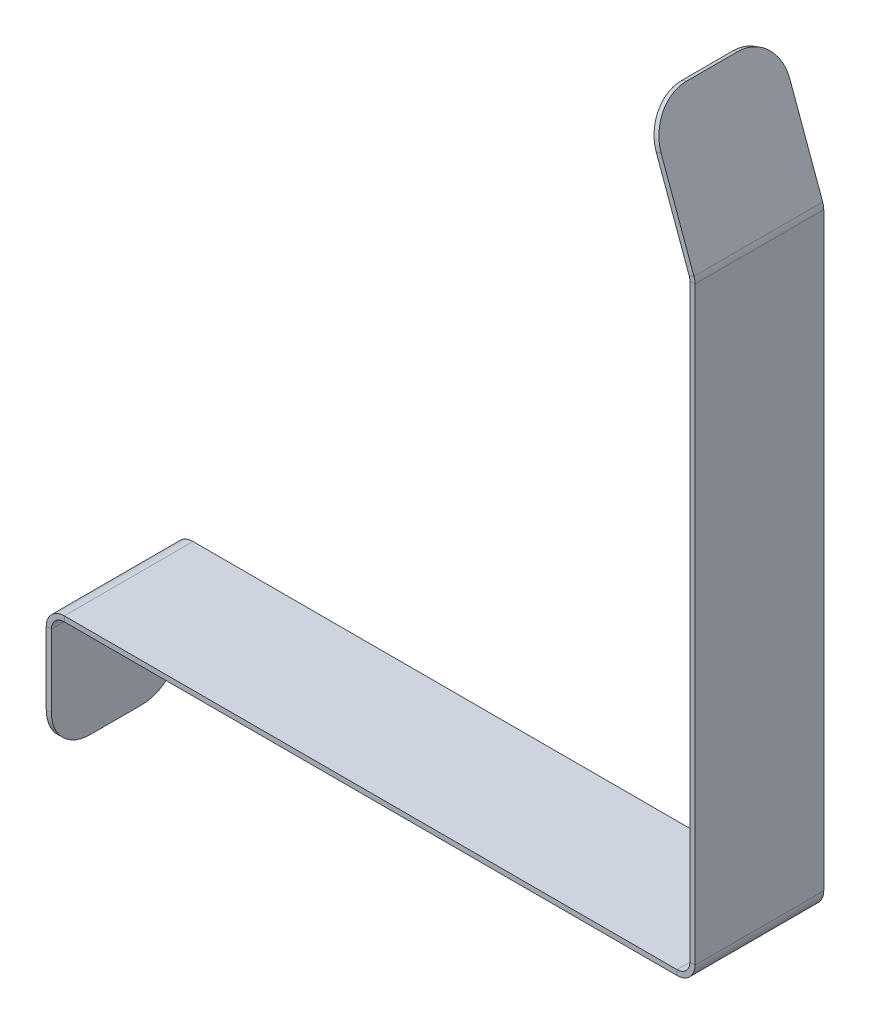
ISO-10303-21;
HEADER;
FILE_DESCRIPTION(('STEP AP214'),'2;1');
FILE_NAME('part.step','',(''),(''),'','','');
FILE_SCHEMA(('AUTOMOTIVE_DESIGN { 1 0 10303 214 1 1 1 1 }'));
ENDSEC;
DATA;
#1=APPLICATION_CONTEXT('core data for automotive mechanical design processes');
#2=APPLICATION_PROTOCOL_DEFINITION('international standard','automotive_design',2000,#1);
#3=PRODUCT_CONTEXT('',#1,'mechanical');
#4=PRODUCT('Part','Part','',(#3));
#5=PRODUCT_RELATED_PRODUCT_CATEGORY('part','',(#4));
#6=PRODUCT_DEFINITION_FORMATION('','',#4);
#7=PRODUCT_DEFINITION_CONTEXT('part definition',#1,'design');
#8=PRODUCT_DEFINITION('design','',#6,#7);
#9=PRODUCT_DEFINITION_SHAPE('','',#8);
#10=(LENGTH_UNIT() NAMED_UNIT(*) SI_UNIT(.MILLI.,.METRE.));
#11=(NAMED_UNIT(*) PLANE_ANGLE_UNIT() SI_UNIT($,.RADIAN.));
#12=(NAMED_UNIT(*) SI_UNIT($,.STERADIAN.) SOLID_ANGLE_UNIT());
#13=UNCERTAINTY_MEASURE_WITH_UNIT(LENGTH_MEASURE(1.E-05),#10,'distance_accuracy_value','');
#14=(GEOMETRIC_REPRESENTATION_CONTEXT(3) GLOBAL_UNCERTAINTY_ASSIGNED_CONTEXT((#13)) GLOBAL_UNIT_ASSIGNED_CONTEXT((#10,
#11,#12)) REPRESENTATION_CONTEXT('',''));
#15=CARTESIAN_POINT('',(0.,0.,0.));
#16=DIRECTION('',(0.,0.,1.));
#17=DIRECTION('',(1.,0.,0.));
#18=AXIS2_PLACEMENT_3D('',#15,#16,#17);
#19=CARTESIAN_POINT('',(0.,0.,5.00000000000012));
#20=DIRECTION('',(-1.,0.,0.));
#21=DIRECTION('',(0.,0.,1.));
#22=AXIS2_PLACEMENT_3D('',#19,#20,#21);
#23=PLANE('',#22);
#24=DIRECTION('',(0.,0.,-1.));
#25=VECTOR('',#24,1.);
#26=CARTESIAN_POINT('',(0.,0.,5.00000000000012));
#27=LINE('',#26,#25);
#28=CARTESIAN_POINT('',(0.,0.,2.00000000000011));
#29=VERTEX_POINT('',#28);
#30=CARTESIAN_POINT('',(0.,0.,-2.00000000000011));
#31=VERTEX_POINT('',#30);
#32=EDGE_CURVE('E217',#29,#31,#27,.T.);
#33=ORIENTED_EDGE('',*,*,#32,.F.);
#34=CARTESIAN_POINT('',(0.,3.,2.00000000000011));
#35=DIRECTION('',(-1.,0.,0.));
#36=DIRECTION('',(0.,0.,1.));
#37=AXIS2_PLACEMENT_3D('',#34,#35,#36);
#38=CIRCLE('',#37,3.);
#39=CARTESIAN_POINT('',(0.,3.,5.00000000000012));
#40=VERTEX_POINT('',#39);
#41=EDGE_CURVE('E221',#29,#40,#38,.T.);
#42=ORIENTED_EDGE('',*,*,#41,.T.);
#43=DIRECTION('',(0.,0.999999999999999,0.));
#44=VECTOR('',#43,1.);
#45=CARTESIAN_POINT('',(0.,0.,5.00000000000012));
#46=LINE('',#45,#44);
#47=CARTESIAN_POINT('',(0.,8.60000000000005,5.00000000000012));
#48=VERTEX_POINT('',#47);
#49=EDGE_CURVE('E234',#40,#48,#46,.T.);
#50=ORIENTED_EDGE('',*,*,#49,.T.);
#51=DIRECTION('',(0.,0.,-1.));
#52=VECTOR('',#51,1.);
#53=CARTESIAN_POINT('',(0.,8.60000000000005,5.00000000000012));
#54=LINE('',#53,#52);
#55=CARTESIAN_POINT('',(0.,8.60000000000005,-5.00000000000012));
#56=VERTEX_POINT('',#55);
#57=EDGE_CURVE('E231',#48,#56,#54,.T.);
#58=ORIENTED_EDGE('',*,*,#57,.T.);
#59=DIRECTION('',(0.,0.999999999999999,0.));
#60=VECTOR('',#59,1.);
#61=CARTESIAN_POINT('',(0.,0.,-5.00000000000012));
#62=LINE('',#61,#60);
#63=CARTESIAN_POINT('',(0.,3.,-5.00000000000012));
#64=VERTEX_POINT('',#63);
#65=EDGE_CURVE('E203',#64,#56,#62,.T.);
#66=ORIENTED_EDGE('',*,*,#65,.F.);
#67=CARTESIAN_POINT('',(0.,3.,-2.00000000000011));
#68=DIRECTION('',(-1.,0.,0.));
#69=DIRECTION('',(0.,0.,1.));
#70=AXIS2_PLACEMENT_3D('',#67,#68,#69);
#71=CIRCLE('',#70,3.);
#72=EDGE_CURVE('E225',#64,#31,#71,.T.);
#73=ORIENTED_EDGE('',*,*,#72,.T.);
#74=EDGE_LOOP('',(#33,#42,#50,#58,#66,#73));
#75=FACE_BOUND('',#74,.T.);
#76=ADVANCED_FACE('F30',(#75),#23,.T.);
#77=CARTESIAN_POINT('',(26.378779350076,-1.11022302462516E-13,5.00000000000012));
#78=DIRECTION('',(0.,0.,1.));
#79=DIRECTION('',(0.,0.999999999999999,0.));
#80=AXIS2_PLACEMENT_3D('',#77,#78,#79);
#81=PLANE('',#80);
#82=DIRECTION('',(-1.,0.,0.));
#83=VECTOR('',#82,1.);
#84=CARTESIAN_POINT('',(26.378779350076,8.59999999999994,5.00000000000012));
#85=LINE('',#84,#83);
#86=CARTESIAN_POINT('',(0.400000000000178,8.60000000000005,5.));
#87=VERTEX_POINT('',#86);
#88=EDGE_CURVE('E190',#87,#48,#85,.T.);
#89=ORIENTED_EDGE('',*,*,#88,.T.);
#90=ORIENTED_EDGE('',*,*,#49,.F.);
#91=DIRECTION('',(-1.,0.,0.));
#92=VECTOR('',#91,1.);
#93=CARTESIAN_POINT('',(26.378779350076,2.99999999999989,5.00000000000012));
#94=LINE('',#93,#92);
#95=CARTESIAN_POINT('',(0.400000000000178,3.,5.));
#96=VERTEX_POINT('',#95);
#97=EDGE_CURVE('E11',#96,#40,#94,.T.);
#98=ORIENTED_EDGE('',*,*,#97,.F.);
#99=DIRECTION('',(0.,0.999999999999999,0.));
#100=VECTOR('',#99,1.);
#101=CARTESIAN_POINT('',(0.400000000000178,0.,5.));
#102=LINE('',#101,#100);
#103=EDGE_CURVE('E222',#96,#87,#102,.T.);
#104=ORIENTED_EDGE('',*,*,#103,.T.);
#105=EDGE_LOOP('',(#89,#90,#98,#104));
#106=FACE_BOUND('',#105,.T.);
#107=ADVANCED_FACE('F32',(#106),#81,.T.);
#108=CARTESIAN_POINT('',(26.378779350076,2.99999999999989,2.));
#109=DIRECTION('',(-1.,0.,0.));
#110=DIRECTION('',(0.,-0.999999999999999,0.));
#111=AXIS2_PLACEMENT_3D('',#108,#109,#110);
#112=CYLINDRICAL_SURFACE('',#111,3.);
#113=ORIENTED_EDGE('',*,*,#41,.F.);
#114=DIRECTION('',(-1.,0.,0.));
#115=VECTOR('',#114,1.);
#116=CARTESIAN_POINT('',(26.378779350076,-1.11022302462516E-13,2.));
#117=LINE('',#116,#115);
#118=CARTESIAN_POINT('',(0.399999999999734,0.,1.99999999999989));
#119=VERTEX_POINT('',#118);
#120=EDGE_CURVE('E38',#119,#29,#117,.T.);
#121=ORIENTED_EDGE('',*,*,#120,.F.);
#122=CARTESIAN_POINT('',(0.399999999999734,3.,1.99999999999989));
#123=DIRECTION('',(-1.,0.,0.));
#124=DIRECTION('',(0.,0.,1.));
#125=AXIS2_PLACEMENT_3D('',#122,#123,#124);
#126=CIRCLE('',#125,3.);
#127=EDGE_CURVE('E52',#96,#119,#126,.F.);
#128=ORIENTED_EDGE('',*,*,#127,.F.);
#129=ORIENTED_EDGE('',*,*,#97,.T.);
#130=EDGE_LOOP('',(#113,#121,#128,#129));
#131=FACE_BOUND('',#130,.T.);
#132=ADVANCED_FACE('F220',(#131),#112,.T.);
#133=CARTESIAN_POINT('',(26.378779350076,-1.11022302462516E-13,5.00000000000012));
#134=DIRECTION('',(0.,0.999999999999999,0.));
#135=DIRECTION('',(-1.,0.,0.));
#136=AXIS2_PLACEMENT_3D('',#133,#134,#135);
#137=PLANE('',#136);
#138=ORIENTED_EDGE('',*,*,#32,.T.);
#139=DIRECTION('',(-1.,0.,0.));
#140=VECTOR('',#139,1.);
#141=CARTESIAN_POINT('',(26.3787793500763,-1.11022302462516E-13,-2.));
#142=LINE('',#141,#140);
#143=CARTESIAN_POINT('',(0.399999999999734,0.,-2.00000000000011));
#144=VERTEX_POINT('',#143);
#145=EDGE_CURVE('E206',#144,#31,#142,.T.);
#146=ORIENTED_EDGE('',*,*,#145,.F.);
#147=DIRECTION('',(0.,0.,-1.));
#148=VECTOR('',#147,1.);
#149=CARTESIAN_POINT('',(0.400000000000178,0.,5.));
#150=LINE('',#149,#148);
#151=EDGE_CURVE('E218',#119,#144,#150,.T.);
#152=ORIENTED_EDGE('',*,*,#151,.F.);
#153=ORIENTED_EDGE('',*,*,#120,.T.);
#154=EDGE_LOOP('',(#138,#146,#152,#153));
#155=FACE_BOUND('',#154,.T.);
#156=ADVANCED_FACE('F215',(#155),#137,.F.);
#157=CARTESIAN_POINT('',(26.3787793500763,2.99999999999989,-2.));
#158=DIRECTION('',(-1.,0.,0.));
#159=DIRECTION('',(0.,-0.999999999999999,0.));
#160=AXIS2_PLACEMENT_3D('',#157,#158,#159);
#161=CYLINDRICAL_SURFACE('',#160,3.);
#162=ORIENTED_EDGE('',*,*,#72,.F.);
#163=DIRECTION('',(-1.,0.,0.));
#164=VECTOR('',#163,1.);
#165=CARTESIAN_POINT('',(26.378779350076,2.99999999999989,-5.00000000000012));
#166=LINE('',#165,#164);
#167=CARTESIAN_POINT('',(0.399999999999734,3.,-5.00000000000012));
#168=VERTEX_POINT('',#167);
#169=EDGE_CURVE('E204',#168,#64,#166,.T.);
#170=ORIENTED_EDGE('',*,*,#169,.F.);
#171=CARTESIAN_POINT('',(0.399999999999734,3.,-2.00000000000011));
#172=DIRECTION('',(-1.,0.,0.));
#173=DIRECTION('',(0.,0.,1.));
#174=AXIS2_PLACEMENT_3D('',#171,#172,#173);
#175=CIRCLE('',#174,3.);
#176=EDGE_CURVE('E196',#144,#168,#175,.F.);
#177=ORIENTED_EDGE('',*,*,#176,.F.);
#178=ORIENTED_EDGE('',*,*,#145,.T.);
#179=EDGE_LOOP('',(#162,#170,#177,#178));
#180=FACE_BOUND('',#179,.T.);
#181=ADVANCED_FACE('F440',(#180),#161,.T.);
#182=CARTESIAN_POINT('',(26.378779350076,-1.11022302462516E-13,-5.00000000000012));
#183=DIRECTION('',(0.,0.,1.));
#184=DIRECTION('',(0.,0.999999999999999,0.));
#185=AXIS2_PLACEMENT_3D('',#182,#183,#184);
#186=PLANE('',#185);
#187=ORIENTED_EDGE('',*,*,#65,.T.);
#188=DIRECTION('',(-1.,0.,0.));
#189=VECTOR('',#188,1.);
#190=CARTESIAN_POINT('',(26.378779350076,8.59999999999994,-5.00000000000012));
#191=LINE('',#190,#189);
#192=CARTESIAN_POINT('',(0.399999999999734,8.60000000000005,-5.00000000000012));
#193=VERTEX_POINT('',#192);
#194=EDGE_CURVE('E174',#193,#56,#191,.T.);
#195=ORIENTED_EDGE('',*,*,#194,.F.);
#196=DIRECTION('',(0.,0.999999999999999,0.));
#197=VECTOR('',#196,1.);
#198=CARTESIAN_POINT('',(0.399999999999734,0.,-5.00000000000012));
#199=LINE('',#198,#197);
#200=EDGE_CURVE('E191',#168,#193,#199,.T.);
#201=ORIENTED_EDGE('',*,*,#200,.F.);
#202=ORIENTED_EDGE('',*,*,#169,.T.);
#203=EDGE_LOOP('',(#187,#195,#201,#202));
#204=FACE_BOUND('',#203,.T.);
#205=ADVANCED_FACE('F202',(#204),#186,.F.);
#206=CARTESIAN_POINT('',(0.400000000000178,0.,5.));
#207=DIRECTION('',(-1.,0.,0.));
#208=DIRECTION('',(0.,0.,1.));
#209=AXIS2_PLACEMENT_3D('',#206,#207,#208);
#210=PLANE('',#209);
#211=ORIENTED_EDGE('',*,*,#103,.F.);
#212=ORIENTED_EDGE('',*,*,#127,.T.);
#213=ORIENTED_EDGE('',*,*,#151,.T.);
#214=ORIENTED_EDGE('',*,*,#176,.T.);
#215=ORIENTED_EDGE('',*,*,#200,.T.);
#216=DIRECTION('',(0.,0.,-1.));
#217=VECTOR('',#216,1.);
#218=CARTESIAN_POINT('',(0.400000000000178,8.60000000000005,5.));
#219=LINE('',#218,#217);
#220=EDGE_CURVE('E183',#87,#193,#219,.T.);
#221=ORIENTED_EDGE('',*,*,#220,.F.);
#222=EDGE_LOOP('',(#211,#212,#213,#214,#215,#221));
#223=FACE_BOUND('',#222,.T.);
#224=ADVANCED_FACE('F194',(#223),#210,.F.);
#225=CARTESIAN_POINT('',(49.9396926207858,57.165693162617,5.));
#226=DIRECTION('',(-0.939692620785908,-0.342020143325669,0.));
#227=DIRECTION('',(0.34202014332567,-0.939692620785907,0.));
#228=AXIS2_PLACEMENT_3D('',#225,#226,#227);
#229=PLANE('',#228);
#230=DIRECTION('',(-0.34202014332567,0.939692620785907,0.));
#231=VECTOR('',#230,1.);
#232=CARTESIAN_POINT('',(49.9396926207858,57.165693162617,5.));
#233=LINE('',#232,#231);
#234=CARTESIAN_POINT('',(49.9396926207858,57.165693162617,5.));
#235=VERTEX_POINT('',#234);
#236=CARTESIAN_POINT('',(47.3863580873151,64.1809221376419,4.99999999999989));
#237=VERTEX_POINT('',#236);
#238=EDGE_CURVE('E267',#235,#237,#233,.T.);
#239=ORIENTED_EDGE('',*,*,#238,.T.);
#240=CARTESIAN_POINT('',(47.3863580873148,64.1809221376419,2.));
#241=DIRECTION('',(-0.939692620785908,-0.342020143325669,0.));
#242=DIRECTION('',(0.34202014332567,-0.939692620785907,0.));
#243=AXIS2_PLACEMENT_3D('',#240,#241,#242);
#244=CIRCLE('',#243,3.);
#245=CARTESIAN_POINT('',(46.3602976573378,66.9999999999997,1.99999999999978));
#246=VERTEX_POINT('',#245);
#247=EDGE_CURVE('E265',#237,#246,#244,.T.);
#248=ORIENTED_EDGE('',*,*,#247,.T.);
#249=DIRECTION('',(0.,0.,-1.));
#250=VECTOR('',#249,1.);
#251=CARTESIAN_POINT('',(46.3602976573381,66.9999999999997,5.));
#252=LINE('',#251,#250);
#253=CARTESIAN_POINT('',(46.3602976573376,66.9999999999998,-2.00000000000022));
#254=VERTEX_POINT('',#253);
#255=EDGE_CURVE('E263',#246,#254,#252,.T.);
#256=ORIENTED_EDGE('',*,*,#255,.T.);
#257=CARTESIAN_POINT('',(47.3863580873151,64.1809221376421,-2.00000000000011));
#258=DIRECTION('',(-0.939692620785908,-0.342020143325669,0.));
#259=DIRECTION('',(0.34202014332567,-0.939692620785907,0.));
#260=AXIS2_PLACEMENT_3D('',#257,#258,#259);
#261=CIRCLE('',#260,3.);
#262=CARTESIAN_POINT('',(47.3863580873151,64.1809221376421,-5.00000000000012));
#263=VERTEX_POINT('',#262);
#264=EDGE_CURVE('E261',#254,#263,#261,.T.);
#265=ORIENTED_EDGE('',*,*,#264,.T.);
#266=DIRECTION('',(-0.34202014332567,0.939692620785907,0.));
#267=VECTOR('',#266,1.);
#268=CARTESIAN_POINT('',(49.9396926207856,57.165693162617,-5.));
#269=LINE('',#268,#267);
#270=CARTESIAN_POINT('',(49.9396926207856,57.165693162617,-5.));
#271=VERTEX_POINT('',#270);
#272=EDGE_CURVE('E258',#271,#263,#269,.T.);
#273=ORIENTED_EDGE('',*,*,#272,.F.);
#274=DIRECTION('',(0.,0.,-1.));
#275=VECTOR('',#274,1.);
#276=CARTESIAN_POINT('',(49.9396926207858,57.165693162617,5.));
#277=LINE('',#276,#275);
#278=EDGE_CURVE('E256',#235,#271,#277,.T.);
#279=ORIENTED_EDGE('',*,*,#278,.F.);
#280=EDGE_LOOP('',(#239,#248,#256,#265,#273,#279));
#281=FACE_BOUND('',#280,.T.);
#282=ADVANCED_FACE('F437',(#281),#229,.T.);
#283=CARTESIAN_POINT('',(22.7355890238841,47.2642092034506,4.99999999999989));
#284=DIRECTION('',(0.,0.,-1.));
#285=DIRECTION('',(0.34202014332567,-0.939692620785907,0.));
#286=AXIS2_PLACEMENT_3D('',#283,#284,#285);
#287=PLANE('',#286);
#288=DIRECTION('',(0.939692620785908,0.342020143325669,0.));
#289=VECTOR('',#288,1.);
#290=CARTESIAN_POINT('',(22.7355890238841,47.2642092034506,4.99999999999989));
#291=LINE('',#290,#289);
#292=CARTESIAN_POINT('',(50.3155696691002,57.3025012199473,4.99999999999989));
#293=VERTEX_POINT('',#292);
#294=EDGE_CURVE('E253',#235,#293,#291,.T.);
#295=ORIENTED_EDGE('',*,*,#294,.T.);
#296=DIRECTION('',(-0.34202014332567,0.939692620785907,0.));
#297=VECTOR('',#296,1.);
#298=CARTESIAN_POINT('',(50.3155696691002,57.3025012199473,4.99999999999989));
#299=LINE('',#298,#297);
#300=CARTESIAN_POINT('',(47.7622351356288,64.3177301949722,4.99999999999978));
#301=VERTEX_POINT('',#300);
#302=EDGE_CURVE('E278',#293,#301,#299,.T.);
#303=ORIENTED_EDGE('',*,*,#302,.T.);
#304=DIRECTION('',(0.939692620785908,0.342020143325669,0.));
#305=VECTOR('',#304,1.);
#306=CARTESIAN_POINT('',(20.1822544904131,54.2794381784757,4.99999999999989));
#307=LINE('',#306,#305);
#308=EDGE_CURVE('E239',#237,#301,#307,.T.);
#309=ORIENTED_EDGE('',*,*,#308,.F.);
#310=ORIENTED_EDGE('',*,*,#238,.F.);
#311=EDGE_LOOP('',(#295,#303,#309,#310));
#312=FACE_BOUND('',#311,.T.);
#313=ADVANCED_FACE('F433',(#312),#287,.F.);
#314=CARTESIAN_POINT('',(20.1822544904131,54.2794381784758,1.99999999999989));
#315=DIRECTION('',(0.939692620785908,0.342020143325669,0.));
#316=DIRECTION('',(-0.34202014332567,0.939692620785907,0.));
#317=AXIS2_PLACEMENT_3D('',#314,#315,#316);
#318=CYLINDRICAL_SURFACE('',#317,3.);
#319=ORIENTED_EDGE('',*,*,#308,.T.);
#320=CARTESIAN_POINT('',(47.762235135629,64.3177301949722,1.99999999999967));
#321=DIRECTION('',(-0.939692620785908,-0.342020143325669,0.));
#322=DIRECTION('',(0.34202014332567,-0.939692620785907,0.));
#323=AXIS2_PLACEMENT_3D('',#320,#321,#322);
#324=CIRCLE('',#323,3.);
#325=CARTESIAN_POINT('',(46.7361747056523,67.13680805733,1.99999999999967));
#326=VERTEX_POINT('',#325);
#327=EDGE_CURVE('E280',#326,#301,#324,.F.);
#328=ORIENTED_EDGE('',*,*,#327,.F.);
#329=DIRECTION('',(0.939692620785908,0.342020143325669,0.));
#330=VECTOR('',#329,1.);
#331=CARTESIAN_POINT('',(19.1561940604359,57.0985160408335,1.99999999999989));
#332=LINE('',#331,#330);
#333=EDGE_CURVE('E242',#246,#326,#332,.T.);
#334=ORIENTED_EDGE('',*,*,#333,.F.);
#335=ORIENTED_EDGE('',*,*,#247,.F.);
#336=EDGE_LOOP('',(#319,#328,#334,#335));
#337=FACE_BOUND('',#336,.T.);
#338=ADVANCED_FACE('F479',(#337),#318,.T.);
#339=CARTESIAN_POINT('',(19.1561940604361,57.0985160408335,4.99999999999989));
#340=DIRECTION('',(0.34202014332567,-0.939692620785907,0.));
#341=DIRECTION('',(0.939692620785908,0.342020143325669,0.));
#342=AXIS2_PLACEMENT_3D('',#339,#340,#341);
#343=PLANE('',#342);
#344=ORIENTED_EDGE('',*,*,#333,.T.);
#345=DIRECTION('',(0.,0.,-1.));
#346=VECTOR('',#345,1.);
#347=CARTESIAN_POINT('',(46.7361747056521,67.13680805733,4.99999999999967));
#348=LINE('',#347,#346);
#349=CARTESIAN_POINT('',(46.7361747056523,67.13680805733,-2.00000000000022));
#350=VERTEX_POINT('',#349);
#351=EDGE_CURVE('E283',#326,#350,#348,.T.);
#352=ORIENTED_EDGE('',*,*,#351,.T.);
#353=DIRECTION('',(0.939692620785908,0.342020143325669,0.));
#354=VECTOR('',#353,1.);
#355=CARTESIAN_POINT('',(19.1561940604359,57.0985160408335,-2.00000000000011));
#356=LINE('',#355,#354);
#357=EDGE_CURVE('E245',#254,#350,#356,.T.);
#358=ORIENTED_EDGE('',*,*,#357,.F.);
#359=ORIENTED_EDGE('',*,*,#255,.F.);
#360=EDGE_LOOP('',(#344,#352,#358,#359));
#361=FACE_BOUND('',#360,.T.);
#362=ADVANCED_FACE('F486',(#361),#343,.F.);
#363=CARTESIAN_POINT('',(20.1822544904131,54.2794381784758,-2.00000000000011));
#364=DIRECTION('',(0.939692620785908,0.342020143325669,0.));
#365=DIRECTION('',(-0.34202014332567,0.939692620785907,0.));
#366=AXIS2_PLACEMENT_3D('',#363,#364,#365);
#367=CYLINDRICAL_SURFACE('',#366,3.);
#368=ORIENTED_EDGE('',*,*,#357,.T.);
#369=CARTESIAN_POINT('',(47.7622351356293,64.3177301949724,-2.00000000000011));
#370=DIRECTION('',(-0.939692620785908,-0.342020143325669,0.));
#371=DIRECTION('',(0.34202014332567,-0.939692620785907,0.));
#372=AXIS2_PLACEMENT_3D('',#369,#370,#371);
#373=CIRCLE('',#372,3.);
#374=CARTESIAN_POINT('',(47.7622351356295,64.3177301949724,-5.00000000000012));
#375=VERTEX_POINT('',#374);
#376=EDGE_CURVE('E269',#375,#350,#373,.F.);
#377=ORIENTED_EDGE('',*,*,#376,.F.);
#378=DIRECTION('',(0.939692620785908,0.342020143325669,0.));
#379=VECTOR('',#378,1.);
#380=CARTESIAN_POINT('',(20.1822544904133,54.2794381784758,-5.00000000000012));
#381=LINE('',#380,#379);
#382=EDGE_CURVE('E248',#263,#375,#381,.T.);
#383=ORIENTED_EDGE('',*,*,#382,.F.);
#384=ORIENTED_EDGE('',*,*,#264,.F.);
#385=EDGE_LOOP('',(#368,#377,#383,#384));
#386=FACE_BOUND('',#385,.T.);
#387=ADVANCED_FACE('F493',(#386),#367,.T.);
#388=CARTESIAN_POINT('',(22.7355890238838,47.2642092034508,-5.00000000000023));
#389=DIRECTION('',(0.,0.,-1.));
#390=DIRECTION('',(0.34202014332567,-0.939692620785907,0.));
#391=AXIS2_PLACEMENT_3D('',#388,#389,#390);
#392=PLANE('',#391);
#393=DIRECTION('',(-0.34202014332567,0.939692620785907,0.));
#394=VECTOR('',#393,1.);
#395=CARTESIAN_POINT('',(50.3155696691,57.3025012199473,-5.00000000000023));
#396=LINE('',#395,#394);
#397=CARTESIAN_POINT('',(50.3155696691,57.3025012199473,-5.00000000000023));
#398=VERTEX_POINT('',#397);
#399=EDGE_CURVE('E272',#398,#375,#396,.T.);
#400=ORIENTED_EDGE('',*,*,#399,.F.);
#401=DIRECTION('',(0.939692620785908,0.342020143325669,0.));
#402=VECTOR('',#401,1.);
#403=CARTESIAN_POINT('',(22.7355890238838,47.2642092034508,-5.00000000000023));
#404=LINE('',#403,#402);
#405=EDGE_CURVE('E251',#271,#398,#404,.T.);
#406=ORIENTED_EDGE('',*,*,#405,.F.);
#407=ORIENTED_EDGE('',*,*,#272,.T.);
#408=ORIENTED_EDGE('',*,*,#382,.T.);
#409=EDGE_LOOP('',(#400,#406,#407,#408));
#410=FACE_BOUND('',#409,.T.);
#411=ADVANCED_FACE('F501',(#410),#392,.T.);
#412=CARTESIAN_POINT('',(50.3155696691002,57.3025012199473,4.99999999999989));
#413=DIRECTION('',(-0.939692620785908,-0.342020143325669,0.));
#414=DIRECTION('',(0.34202014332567,-0.939692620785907,0.));
#415=AXIS2_PLACEMENT_3D('',#412,#413,#414);
#416=PLANE('',#415);
#417=ORIENTED_EDGE('',*,*,#351,.F.);
#418=ORIENTED_EDGE('',*,*,#327,.T.);
#419=ORIENTED_EDGE('',*,*,#302,.F.);
#420=DIRECTION('',(0.,0.,-1.));
#421=VECTOR('',#420,1.);
#422=CARTESIAN_POINT('',(50.3155696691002,57.3025012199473,4.99999999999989));
#423=LINE('',#422,#421);
#424=EDGE_CURVE('E275',#293,#398,#423,.T.);
#425=ORIENTED_EDGE('',*,*,#424,.T.);
#426=ORIENTED_EDGE('',*,*,#399,.T.);
#427=ORIENTED_EDGE('',*,*,#376,.T.);
#428=EDGE_LOOP('',(#417,#418,#419,#425,#426,#427));
#429=FACE_BOUND('',#428,.T.);
#430=ADVANCED_FACE('F509',(#429),#416,.F.);
#431=CARTESIAN_POINT('',(50.4,10.9999999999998,5.00000000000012));
#432=DIRECTION('',(-1.,0.,0.));
#433=DIRECTION('',(0.,0.,1.));
#434=AXIS2_PLACEMENT_3D('',#431,#432,#433);
#435=PLANE('',#434);
#436=DIRECTION('',(0.,0.999999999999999,0.));
#437=VECTOR('',#436,1.);
#438=CARTESIAN_POINT('',(50.3999999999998,10.9999999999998,-5.));
#439=LINE('',#438,#437);
#440=CARTESIAN_POINT('',(50.3999999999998,10.9999999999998,-5.));
#441=VERTEX_POINT('',#440);
#442=CARTESIAN_POINT('',(50.4000000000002,56.8236730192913,-5.00000000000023));
#443=VERTEX_POINT('',#442);
#444=EDGE_CURVE('E314',#441,#443,#439,.T.);
#445=ORIENTED_EDGE('',*,*,#444,.T.);
#446=DIRECTION('',(0.,0.,-1.));
#447=VECTOR('',#446,1.);
#448=CARTESIAN_POINT('',(50.4000000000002,56.8236730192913,4.99999999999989));
#449=LINE('',#448,#447);
#450=CARTESIAN_POINT('',(50.4000000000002,56.8236730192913,4.99999999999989));
#451=VERTEX_POINT('',#450);
#452=EDGE_CURVE('E312',#451,#443,#449,.T.);
#453=ORIENTED_EDGE('',*,*,#452,.F.);
#454=DIRECTION('',(0.,0.999999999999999,0.));
#455=VECTOR('',#454,1.);
#456=CARTESIAN_POINT('',(50.4,10.9999999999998,5.00000000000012));
#457=LINE('',#456,#455);
#458=CARTESIAN_POINT('',(50.4,10.9999999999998,5.00000000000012));
#459=VERTEX_POINT('',#458);
#460=EDGE_CURVE('E309',#459,#451,#457,.T.);
#461=ORIENTED_EDGE('',*,*,#460,.F.);
#462=DIRECTION('',(0.,0.,-1.));
#463=VECTOR('',#462,1.);
#464=CARTESIAN_POINT('',(50.4,10.9999999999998,5.00000000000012));
#465=LINE('',#464,#463);
#466=EDGE_CURVE('E306',#459,#441,#465,.T.);
#467=ORIENTED_EDGE('',*,*,#466,.T.);
#468=EDGE_LOOP('',(#445,#453,#461,#467));
#469=FACE_BOUND('',#468,.T.);
#470=ADVANCED_FACE('F517',(#469),#435,.F.);
#471=CARTESIAN_POINT('',(-43.8042431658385,11.,-5.));
#472=DIRECTION('',(0.,0.,-1.));
#473=DIRECTION('',(0.,-0.999999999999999,0.));
#474=AXIS2_PLACEMENT_3D('',#471,#472,#473);
#475=PLANE('',#474);
#476=ORIENTED_EDGE('',*,*,#444,.F.);
#477=DIRECTION('',(1.,0.,0.));
#478=VECTOR('',#477,1.);
#479=CARTESIAN_POINT('',(-43.8042431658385,11.,-5.));
#480=LINE('',#479,#478);
#481=CARTESIAN_POINT('',(49.9999999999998,10.9999999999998,-5.));
#482=VERTEX_POINT('',#481);
#483=EDGE_CURVE('E285',#482,#441,#480,.T.);
#484=ORIENTED_EDGE('',*,*,#483,.F.);
#485=DIRECTION('',(0.,0.999999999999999,0.));
#486=VECTOR('',#485,1.);
#487=CARTESIAN_POINT('',(49.9999999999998,10.9999999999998,-5.));
#488=LINE('',#487,#486);
#489=CARTESIAN_POINT('',(49.9999999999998,56.8236730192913,-5.00000000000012));
#490=VERTEX_POINT('',#489);
#491=EDGE_CURVE('E303',#482,#490,#488,.T.);
#492=ORIENTED_EDGE('',*,*,#491,.T.);
#493=DIRECTION('',(1.,0.,0.));
#494=VECTOR('',#493,1.);
#495=CARTESIAN_POINT('',(-43.8042431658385,56.8236730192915,-5.00000000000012));
#496=LINE('',#495,#494);
#497=EDGE_CURVE('E292',#490,#443,#496,.T.);
#498=ORIENTED_EDGE('',*,*,#497,.T.);
#499=EDGE_LOOP('',(#476,#484,#492,#498));
#500=FACE_BOUND('',#499,.T.);
#501=ADVANCED_FACE('F408',(#500),#475,.T.);
#502=CARTESIAN_POINT('',(-43.8042431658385,11.,5.));
#503=DIRECTION('',(0.,0.,-1.));
#504=DIRECTION('',(0.,-0.999999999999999,0.));
#505=AXIS2_PLACEMENT_3D('',#502,#503,#504);
#506=PLANE('',#505);
#507=DIRECTION('',(1.,0.,0.));
#508=VECTOR('',#507,1.);
#509=CARTESIAN_POINT('',(-43.8042431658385,11.,5.));
#510=LINE('',#509,#508);
#511=CARTESIAN_POINT('',(50.,10.9999999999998,5.00000000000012));
#512=VERTEX_POINT('',#511);
#513=EDGE_CURVE('E287',#512,#459,#510,.T.);
#514=ORIENTED_EDGE('',*,*,#513,.T.);
#515=ORIENTED_EDGE('',*,*,#460,.T.);
#516=DIRECTION('',(1.,0.,0.));
#517=VECTOR('',#516,1.);
#518=CARTESIAN_POINT('',(-43.8042431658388,56.8236730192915,4.99999999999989));
#519=LINE('',#518,#517);
#520=CARTESIAN_POINT('',(50.,56.8236730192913,5.));
#521=VERTEX_POINT('',#520);
#522=EDGE_CURVE('E290',#521,#451,#519,.T.);
#523=ORIENTED_EDGE('',*,*,#522,.F.);
#524=DIRECTION('',(0.,0.999999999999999,0.));
#525=VECTOR('',#524,1.);
#526=CARTESIAN_POINT('',(50.,10.9999999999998,5.00000000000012));
#527=LINE('',#526,#525);
#528=EDGE_CURVE('E298',#512,#521,#527,.T.);
#529=ORIENTED_EDGE('',*,*,#528,.F.);
#530=EDGE_LOOP('',(#514,#515,#523,#529));
#531=FACE_BOUND('',#530,.T.);
#532=ADVANCED_FACE('F532',(#531),#506,.F.);
#533=CARTESIAN_POINT('',(50.,10.9999999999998,5.00000000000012));
#534=DIRECTION('',(-1.,0.,0.));
#535=DIRECTION('',(0.,0.,1.));
#536=AXIS2_PLACEMENT_3D('',#533,#534,#535);
#537=PLANE('',#536);
#538=ORIENTED_EDGE('',*,*,#491,.F.);
#539=DIRECTION('',(0.,0.,-1.));
#540=VECTOR('',#539,1.);
#541=CARTESIAN_POINT('',(50.,10.9999999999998,5.00000000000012));
#542=LINE('',#541,#540);
#543=EDGE_CURVE('E301',#512,#482,#542,.T.);
#544=ORIENTED_EDGE('',*,*,#543,.F.);
#545=ORIENTED_EDGE('',*,*,#528,.T.);
#546=DIRECTION('',(0.,0.,-1.));
#547=VECTOR('',#546,1.);
#548=CARTESIAN_POINT('',(50.,56.8236730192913,5.));
#549=LINE('',#548,#547);
#550=EDGE_CURVE('E295',#521,#490,#549,.T.);
#551=ORIENTED_EDGE('',*,*,#550,.T.);
#552=EDGE_LOOP('',(#538,#544,#545,#551));
#553=FACE_BOUND('',#552,.T.);
#554=ADVANCED_FACE('F404',(#553),#537,.T.);
#555=CARTESIAN_POINT('',(1.39999999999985,9.60000000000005,5.00000000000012));
#556=DIRECTION('',(0.,0.999999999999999,0.));
#557=DIRECTION('',(0.,0.,1.));
#558=AXIS2_PLACEMENT_3D('',#555,#556,#557);
#559=PLANE('',#558);
#560=DIRECTION('',(1.,0.,0.));
#561=VECTOR('',#560,1.);
#562=CARTESIAN_POINT('',(1.39999999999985,9.60000000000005,-5.00000000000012));
#563=LINE('',#562,#561);
#564=CARTESIAN_POINT('',(1.39999999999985,9.60000000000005,-5.00000000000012));
#565=VERTEX_POINT('',#564);
#566=CARTESIAN_POINT('',(48.9999999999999,9.59999999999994,-5.));
#567=VERTEX_POINT('',#566);
#568=EDGE_CURVE('E345',#565,#567,#563,.T.);
#569=ORIENTED_EDGE('',*,*,#568,.T.);
#570=DIRECTION('',(0.,0.,-1.));
#571=VECTOR('',#570,1.);
#572=CARTESIAN_POINT('',(48.9999999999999,9.59999999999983,5.00000000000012));
#573=LINE('',#572,#571);
#574=CARTESIAN_POINT('',(48.9999999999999,9.59999999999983,5.00000000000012));
#575=VERTEX_POINT('',#574);
#576=EDGE_CURVE('E343',#575,#567,#573,.T.);
#577=ORIENTED_EDGE('',*,*,#576,.F.);
#578=DIRECTION('',(1.,0.,0.));
#579=VECTOR('',#578,1.);
#580=CARTESIAN_POINT('',(1.39999999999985,9.60000000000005,5.00000000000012));
#581=LINE('',#580,#579);
#582=CARTESIAN_POINT('',(1.39999999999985,9.60000000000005,5.00000000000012));
#583=VERTEX_POINT('',#582);
#584=EDGE_CURVE('E340',#583,#575,#581,.T.);
#585=ORIENTED_EDGE('',*,*,#584,.F.);
#586=DIRECTION('',(0.,0.,-1.));
#587=VECTOR('',#586,1.);
#588=CARTESIAN_POINT('',(1.39999999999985,9.60000000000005,5.00000000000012));
#589=LINE('',#588,#587);
#590=EDGE_CURVE('E338',#583,#565,#589,.T.);
#591=ORIENTED_EDGE('',*,*,#590,.T.);
#592=EDGE_LOOP('',(#569,#577,#585,#591));
#593=FACE_BOUND('',#592,.T.);
#594=ADVANCED_FACE('F386',(#593),#559,.F.);
#595=CARTESIAN_POINT('',(1.39999999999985,107.278157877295,-5.00000000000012));
#596=DIRECTION('',(0.,0.,-1.));
#597=DIRECTION('',(-1.,0.,0.));
#598=AXIS2_PLACEMENT_3D('',#595,#596,#597);
#599=PLANE('',#598);
#600=ORIENTED_EDGE('',*,*,#568,.F.);
#601=DIRECTION('',(0.,-0.999999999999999,0.));
#602=VECTOR('',#601,1.);
#603=CARTESIAN_POINT('',(1.39999999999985,107.278157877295,-5.00000000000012));
#604=LINE('',#603,#602);
#605=CARTESIAN_POINT('',(1.39999999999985,10.,-5.00000000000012));
#606=VERTEX_POINT('',#605);
#607=EDGE_CURVE('E176',#606,#565,#604,.T.);
#608=ORIENTED_EDGE('',*,*,#607,.F.);
#609=DIRECTION('',(1.,0.,0.));
#610=VECTOR('',#609,1.);
#611=CARTESIAN_POINT('',(1.39999999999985,10.,-5.00000000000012));
#612=LINE('',#611,#610);
#613=CARTESIAN_POINT('',(48.9999999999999,9.9999999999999,-5.));
#614=VERTEX_POINT('',#613);
#615=EDGE_CURVE('E335',#606,#614,#612,.T.);
#616=ORIENTED_EDGE('',*,*,#615,.T.);
#617=DIRECTION('',(0.,-0.999999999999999,0.));
#618=VECTOR('',#617,1.);
#619=CARTESIAN_POINT('',(48.9999999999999,107.278157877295,-5.00000000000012));
#620=LINE('',#619,#618);
#621=EDGE_CURVE('E323',#614,#567,#620,.T.);
#622=ORIENTED_EDGE('',*,*,#621,.T.);
#623=EDGE_LOOP('',(#600,#608,#616,#622));
#624=FACE_BOUND('',#623,.T.);
#625=ADVANCED_FACE('F389',(#624),#599,.T.);
#626=CARTESIAN_POINT('',(1.39999999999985,107.278157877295,5.));
#627=DIRECTION('',(0.,0.,-1.));
#628=DIRECTION('',(-1.,0.,0.));
#629=AXIS2_PLACEMENT_3D('',#626,#627,#628);
#630=PLANE('',#629);
#631=DIRECTION('',(0.,-0.999999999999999,0.));
#632=VECTOR('',#631,1.);
#633=CARTESIAN_POINT('',(1.39999999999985,107.278157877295,5.));
#634=LINE('',#633,#632);
#635=CARTESIAN_POINT('',(1.39999999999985,10.,5.00000000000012));
#636=VERTEX_POINT('',#635);
#637=EDGE_CURVE('E318',#636,#583,#634,.T.);
#638=ORIENTED_EDGE('',*,*,#637,.T.);
#639=ORIENTED_EDGE('',*,*,#584,.T.);
#640=DIRECTION('',(0.,-0.999999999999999,0.));
#641=VECTOR('',#640,1.);
#642=CARTESIAN_POINT('',(48.9999999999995,107.278157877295,4.99999999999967));
#643=LINE('',#642,#641);
#644=CARTESIAN_POINT('',(48.9999999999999,9.99999999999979,5.));
#645=VERTEX_POINT('',#644);
#646=EDGE_CURVE('E321',#645,#575,#643,.T.);
#647=ORIENTED_EDGE('',*,*,#646,.F.);
#648=DIRECTION('',(1.,0.,0.));
#649=VECTOR('',#648,1.);
#650=CARTESIAN_POINT('',(1.39999999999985,10.,5.00000000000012));
#651=LINE('',#650,#649);
#652=EDGE_CURVE('E329',#636,#645,#651,.T.);
#653=ORIENTED_EDGE('',*,*,#652,.F.);
#654=EDGE_LOOP('',(#638,#639,#647,#653));
#655=FACE_BOUND('',#654,.T.);
#656=ADVANCED_FACE('F382',(#655),#630,.F.);
#657=CARTESIAN_POINT('',(1.39999999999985,10.,5.00000000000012));
#658=DIRECTION('',(0.,0.999999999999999,0.));
#659=DIRECTION('',(0.,0.,1.));
#660=AXIS2_PLACEMENT_3D('',#657,#658,#659);
#661=PLANE('',#660);
#662=ORIENTED_EDGE('',*,*,#615,.F.);
#663=DIRECTION('',(0.,0.,-1.));
#664=VECTOR('',#663,1.);
#665=CARTESIAN_POINT('',(1.39999999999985,10.,5.00000000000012));
#666=LINE('',#665,#664);
#667=EDGE_CURVE('E332',#636,#606,#666,.T.);
#668=ORIENTED_EDGE('',*,*,#667,.F.);
#669=ORIENTED_EDGE('',*,*,#652,.T.);
#670=DIRECTION('',(0.,0.,-1.));
#671=VECTOR('',#670,1.);
#672=CARTESIAN_POINT('',(48.9999999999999,9.99999999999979,5.));
#673=LINE('',#672,#671);
#674=EDGE_CURVE('E326',#645,#614,#673,.T.);
#675=ORIENTED_EDGE('',*,*,#674,.T.);
#676=EDGE_LOOP('',(#662,#668,#669,#675));
#677=FACE_BOUND('',#676,.T.);
#678=ADVANCED_FACE('F416',(#677),#661,.T.);
#679=CARTESIAN_POINT('',(48.9999999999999,10.9999999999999,-5.));
#680=DIRECTION('',(0.,0.,-1.));
#681=DIRECTION('',(-1.,0.,0.));
#682=AXIS2_PLACEMENT_3D('',#679,#680,#681);
#683=PLANE('',#682);
#684=ORIENTED_EDGE('',*,*,#621,.F.);
#685=CARTESIAN_POINT('',(48.9999999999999,10.9999999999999,-5.));
#686=DIRECTION('',(0.,0.,-1.));
#687=DIRECTION('',(-1.,0.,0.));
#688=AXIS2_PLACEMENT_3D('',#685,#686,#687);
#689=CIRCLE('',#688,1.);
#690=EDGE_CURVE('E354',#614,#482,#689,.F.);
#691=ORIENTED_EDGE('',*,*,#690,.T.);
#692=ORIENTED_EDGE('',*,*,#483,.T.);
#693=CARTESIAN_POINT('',(48.9999999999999,10.9999999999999,-5.));
#694=DIRECTION('',(0.,0.,-1.));
#695=DIRECTION('',(-1.,0.,0.));
#696=AXIS2_PLACEMENT_3D('',#693,#694,#695);
#697=CIRCLE('',#696,1.4);
#698=EDGE_CURVE('E348',#567,#441,#697,.F.);
#699=ORIENTED_EDGE('',*,*,#698,.F.);
#700=EDGE_LOOP('',(#684,#691,#692,#699));
#701=FACE_BOUND('',#700,.T.);
#702=ADVANCED_FACE('F394',(#701),#683,.T.);
#703=CARTESIAN_POINT('',(48.9999999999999,10.9999999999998,5.));
#704=DIRECTION('',(0.,0.,1.));
#705=DIRECTION('',(1.,0.,0.));
#706=AXIS2_PLACEMENT_3D('',#703,#704,#705);
#707=PLANE('',#706);
#708=ORIENTED_EDGE('',*,*,#513,.F.);
#709=CARTESIAN_POINT('',(48.9999999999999,10.9999999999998,5.));
#710=DIRECTION('',(0.,0.,-1.));
#711=DIRECTION('',(-1.,0.,0.));
#712=AXIS2_PLACEMENT_3D('',#709,#710,#711);
#713=CIRCLE('',#712,1.);
#714=EDGE_CURVE('E357',#512,#645,#713,.T.);
#715=ORIENTED_EDGE('',*,*,#714,.T.);
#716=ORIENTED_EDGE('',*,*,#646,.T.);
#717=CARTESIAN_POINT('',(48.9999999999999,10.9999999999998,5.));
#718=DIRECTION('',(0.,0.,-1.));
#719=DIRECTION('',(-1.,0.,0.));
#720=AXIS2_PLACEMENT_3D('',#717,#718,#719);
#721=CIRCLE('',#720,1.4);
#722=EDGE_CURVE('E351',#459,#575,#721,.T.);
#723=ORIENTED_EDGE('',*,*,#722,.F.);
#724=EDGE_LOOP('',(#708,#715,#716,#723));
#725=FACE_BOUND('',#724,.T.);
#726=ADVANCED_FACE('F414',(#725),#707,.T.);
#727=CARTESIAN_POINT('',(48.9999999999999,10.9999999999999,122.10634315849));
#728=DIRECTION('',(0.,0.,-1.));
#729=DIRECTION('',(-1.,0.,0.));
#730=AXIS2_PLACEMENT_3D('',#727,#728,#729);
#731=CYLINDRICAL_SURFACE('',#730,1.4);
#732=ORIENTED_EDGE('',*,*,#722,.T.);
#733=ORIENTED_EDGE('',*,*,#576,.T.);
#734=ORIENTED_EDGE('',*,*,#698,.T.);
#735=ORIENTED_EDGE('',*,*,#466,.F.);
#736=EDGE_LOOP('',(#732,#733,#734,#735));
#737=FACE_BOUND('',#736,.T.);
#738=ADVANCED_FACE('F411',(#737),#731,.T.);
#739=CARTESIAN_POINT('',(48.9999999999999,10.9999999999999,122.10634315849));
#740=DIRECTION('',(0.,0.,-1.));
#741=DIRECTION('',(-1.,0.,0.));
#742=AXIS2_PLACEMENT_3D('',#739,#740,#741);
#743=CYLINDRICAL_SURFACE('',#742,1.);
#744=ORIENTED_EDGE('',*,*,#714,.F.);
#745=ORIENTED_EDGE('',*,*,#543,.T.);
#746=ORIENTED_EDGE('',*,*,#690,.F.);
#747=ORIENTED_EDGE('',*,*,#674,.F.);
#748=EDGE_LOOP('',(#744,#745,#746,#747));
#749=FACE_BOUND('',#748,.T.);
#750=ADVANCED_FACE('F399',(#749),#743,.F.);
#751=CARTESIAN_POINT('',(49.0000000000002,56.8236730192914,-5.00000000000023));
#752=DIRECTION('',(0.,0.,-1.));
#753=DIRECTION('',(-1.,0.,0.));
#754=AXIS2_PLACEMENT_3D('',#751,#752,#753);
#755=PLANE('',#754);
#756=ORIENTED_EDGE('',*,*,#497,.F.);
#757=CARTESIAN_POINT('',(49.0000000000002,56.8236730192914,-5.00000000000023));
#758=DIRECTION('',(0.,0.,-1.));
#759=DIRECTION('',(-1.,0.,0.));
#760=AXIS2_PLACEMENT_3D('',#757,#758,#759);
#761=CIRCLE('',#760,1.);
#762=EDGE_CURVE('E365',#490,#271,#761,.F.);
#763=ORIENTED_EDGE('',*,*,#762,.T.);
#764=ORIENTED_EDGE('',*,*,#405,.T.);
#765=CARTESIAN_POINT('',(49.0000000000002,56.8236730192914,-5.00000000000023));
#766=DIRECTION('',(0.,0.,-1.));
#767=DIRECTION('',(-1.,0.,0.));
#768=AXIS2_PLACEMENT_3D('',#765,#766,#767);
#769=CIRCLE('',#768,1.4);
#770=EDGE_CURVE('E359',#443,#398,#769,.F.);
#771=ORIENTED_EDGE('',*,*,#770,.F.);
#772=EDGE_LOOP('',(#756,#763,#764,#771));
#773=FACE_BOUND('',#772,.T.);
#774=ADVANCED_FACE('F596',(#773),#755,.T.);
#775=CARTESIAN_POINT('',(48.9999999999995,56.8236730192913,4.99999999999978));
#776=DIRECTION('',(0.,0.,1.));
#777=DIRECTION('',(1.,0.,0.));
#778=AXIS2_PLACEMENT_3D('',#775,#776,#777);
#779=PLANE('',#778);
#780=ORIENTED_EDGE('',*,*,#294,.F.);
#781=CARTESIAN_POINT('',(48.9999999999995,56.8236730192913,4.99999999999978));
#782=DIRECTION('',(0.,0.,-1.));
#783=DIRECTION('',(-1.,0.,0.));
#784=AXIS2_PLACEMENT_3D('',#781,#782,#783);
#785=CIRCLE('',#784,1.);
#786=EDGE_CURVE('E368',#235,#521,#785,.T.);
#787=ORIENTED_EDGE('',*,*,#786,.T.);
#788=ORIENTED_EDGE('',*,*,#522,.T.);
#789=CARTESIAN_POINT('',(48.9999999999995,56.8236730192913,4.99999999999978));
#790=DIRECTION('',(0.,0.,-1.));
#791=DIRECTION('',(-1.,0.,0.));
#792=AXIS2_PLACEMENT_3D('',#789,#790,#791);
#793=CIRCLE('',#792,1.4);
#794=EDGE_CURVE('E362',#293,#451,#793,.T.);
#795=ORIENTED_EDGE('',*,*,#794,.F.);
#796=EDGE_LOOP('',(#780,#787,#788,#795));
#797=FACE_BOUND('',#796,.T.);
#798=ADVANCED_FACE('F605',(#797),#779,.T.);
#799=CARTESIAN_POINT('',(49.0000000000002,56.8236730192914,88.7555964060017));
#800=DIRECTION('',(0.,0.,-1.));
#801=DIRECTION('',(-1.,0.,0.));
#802=AXIS2_PLACEMENT_3D('',#799,#800,#801);
#803=CYLINDRICAL_SURFACE('',#802,1.4);
#804=ORIENTED_EDGE('',*,*,#794,.T.);
#805=ORIENTED_EDGE('',*,*,#452,.T.);
#806=ORIENTED_EDGE('',*,*,#770,.T.);
#807=ORIENTED_EDGE('',*,*,#424,.F.);
#808=EDGE_LOOP('',(#804,#805,#806,#807));
#809=FACE_BOUND('',#808,.T.);
#810=ADVANCED_FACE('F615',(#809),#803,.T.);
#811=CARTESIAN_POINT('',(49.0000000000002,56.8236730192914,88.7555964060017));
#812=DIRECTION('',(0.,0.,-1.));
#813=DIRECTION('',(-1.,0.,0.));
#814=AXIS2_PLACEMENT_3D('',#811,#812,#813);
#815=CYLINDRICAL_SURFACE('',#814,1.);
#816=ORIENTED_EDGE('',*,*,#786,.F.);
#817=ORIENTED_EDGE('',*,*,#278,.T.);
#818=ORIENTED_EDGE('',*,*,#762,.F.);
#819=ORIENTED_EDGE('',*,*,#550,.F.);
#820=EDGE_LOOP('',(#816,#817,#818,#819));
#821=FACE_BOUND('',#820,.T.);
#822=ADVANCED_FACE('F625',(#821),#815,.F.);
#823=CARTESIAN_POINT('',(1.39999999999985,8.60000000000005,-5.00000000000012));
#824=DIRECTION('',(0.,0.,1.));
#825=DIRECTION('',(1.,0.,0.));
#826=AXIS2_PLACEMENT_3D('',#823,#824,#825);
#827=PLANE('',#826);
#828=ORIENTED_EDGE('',*,*,#607,.T.);
#829=CARTESIAN_POINT('',(1.39999999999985,8.60000000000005,-5.00000000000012));
#830=DIRECTION('',(0.,0.,-1.));
#831=DIRECTION('',(-1.,0.,0.));
#832=AXIS2_PLACEMENT_3D('',#829,#830,#831);
#833=CIRCLE('',#832,1.);
#834=EDGE_CURVE('E169',#193,#565,#833,.T.);
#835=ORIENTED_EDGE('',*,*,#834,.F.);
#836=ORIENTED_EDGE('',*,*,#194,.T.);
#837=CARTESIAN_POINT('',(1.39999999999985,8.60000000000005,-5.00000000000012));
#838=DIRECTION('',(0.,0.,-1.));
#839=DIRECTION('',(-1.,0.,0.));
#840=AXIS2_PLACEMENT_3D('',#837,#838,#839);
#841=CIRCLE('',#840,1.4);
#842=EDGE_CURVE('E371',#56,#606,#841,.T.);
#843=ORIENTED_EDGE('',*,*,#842,.T.);
#844=EDGE_LOOP('',(#828,#835,#836,#843));
#845=FACE_BOUND('',#844,.T.);
#846=ADVANCED_FACE('F171',(#845),#827,.F.);
#847=CARTESIAN_POINT('',(1.39999999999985,8.60000000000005,5.00000000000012));
#848=DIRECTION('',(0.,0.,-1.));
#849=DIRECTION('',(-1.,0.,0.));
#850=AXIS2_PLACEMENT_3D('',#847,#848,#849);
#851=PLANE('',#850);
#852=CARTESIAN_POINT('',(1.39999999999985,8.60000000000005,5.00000000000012));
#853=DIRECTION('',(0.,0.,-1.));
#854=DIRECTION('',(-1.,0.,0.));
#855=AXIS2_PLACEMENT_3D('',#852,#853,#854);
#856=CIRCLE('',#855,1.);
#857=EDGE_CURVE('E179',#583,#87,#856,.F.);
#858=ORIENTED_EDGE('',*,*,#857,.F.);
#859=ORIENTED_EDGE('',*,*,#637,.F.);
#860=CARTESIAN_POINT('',(1.39999999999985,8.60000000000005,5.00000000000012));
#861=DIRECTION('',(0.,0.,-1.));
#862=DIRECTION('',(-1.,0.,0.));
#863=AXIS2_PLACEMENT_3D('',#860,#861,#862);
#864=CIRCLE('',#863,1.4);
#865=EDGE_CURVE('E45',#636,#48,#864,.F.);
#866=ORIENTED_EDGE('',*,*,#865,.T.);
#867=ORIENTED_EDGE('',*,*,#88,.F.);
#868=EDGE_LOOP('',(#858,#859,#866,#867));
#869=FACE_BOUND('',#868,.T.);
#870=ADVANCED_FACE('F380',(#869),#851,.F.);
#871=CARTESIAN_POINT('',(1.39999999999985,8.59999999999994,88.3603276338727));
#872=DIRECTION('',(0.,0.,-1.));
#873=DIRECTION('',(-1.,0.,0.));
#874=AXIS2_PLACEMENT_3D('',#871,#872,#873);
#875=CYLINDRICAL_SURFACE('',#874,1.4);
#876=ORIENTED_EDGE('',*,*,#57,.F.);
#877=ORIENTED_EDGE('',*,*,#865,.F.);
#878=ORIENTED_EDGE('',*,*,#667,.T.);
#879=ORIENTED_EDGE('',*,*,#842,.F.);
#880=EDGE_LOOP('',(#876,#877,#878,#879));
#881=FACE_BOUND('',#880,.T.);
#882=ADVANCED_FACE('F374',(#881),#875,.T.);
#883=CARTESIAN_POINT('',(1.39999999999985,8.59999999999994,88.3603276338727));
#884=DIRECTION('',(0.,0.,-1.));
#885=DIRECTION('',(-1.,0.,0.));
#886=AXIS2_PLACEMENT_3D('',#883,#884,#885);
#887=CYLINDRICAL_SURFACE('',#886,1.);
#888=ORIENTED_EDGE('',*,*,#220,.T.);
#889=ORIENTED_EDGE('',*,*,#834,.T.);
#890=ORIENTED_EDGE('',*,*,#590,.F.);
#891=ORIENTED_EDGE('',*,*,#857,.T.);
#892=EDGE_LOOP('',(#888,#889,#890,#891));
#893=FACE_BOUND('',#892,.T.);
#894=ADVANCED_FACE('F185',(#893),#887,.F.);
#895=CLOSED_SHELL('',(#76,#107,#132,#156,#181,#205,#224,#282,#313,#338,#362,#387,#411,#430,#470,
#501,#532,#554,#594,#625,#656,#678,#702,#726,#738,#750,#774,#798,#810,#822,#846,#870,#882,#894));
#896=MANIFOLD_SOLID_BREP('B2',#895);
#897=ADVANCED_BREP_SHAPE_REPRESENTATION('',(#18,#896),#14);
#898=SHAPE_DEFINITION_REPRESENTATION(#9,#897);
ENDSEC;
END-ISO-10303-21;
